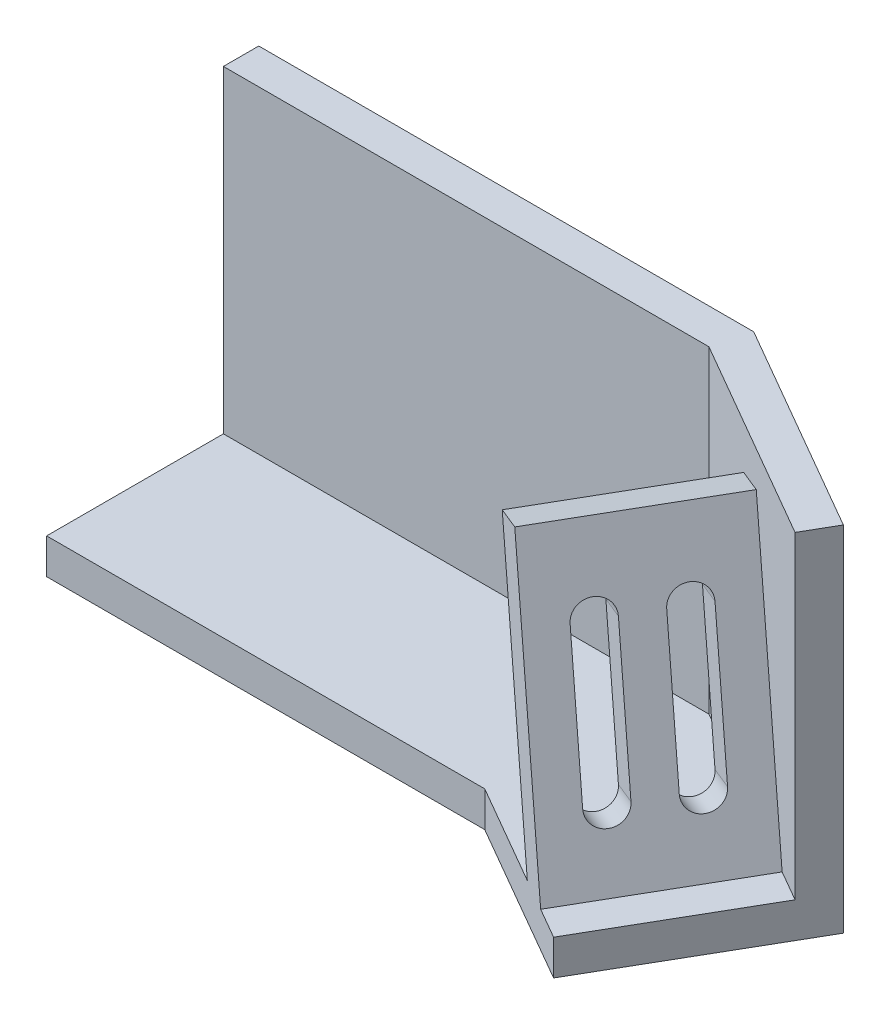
ISO-10303-21;
HEADER;
FILE_DESCRIPTION(('STEP AP214'),'2;1');
FILE_NAME('part.step','',(''),(''),'','','');
FILE_SCHEMA(('AUTOMOTIVE_DESIGN { 1 0 10303 214 1 1 1 1 }'));
ENDSEC;
DATA;
#1=APPLICATION_CONTEXT('core data for automotive mechanical design processes');
#2=APPLICATION_PROTOCOL_DEFINITION('international standard','automotive_design',2000,#1);
#3=PRODUCT_CONTEXT('',#1,'mechanical');
#4=PRODUCT('Part','Part','',(#3));
#5=PRODUCT_RELATED_PRODUCT_CATEGORY('part','',(#4));
#6=PRODUCT_DEFINITION_FORMATION('','',#4);
#7=PRODUCT_DEFINITION_CONTEXT('part definition',#1,'design');
#8=PRODUCT_DEFINITION('design','',#6,#7);
#9=PRODUCT_DEFINITION_SHAPE('','',#8);
#10=(LENGTH_UNIT() NAMED_UNIT(*) SI_UNIT(.MILLI.,.METRE.));
#11=(NAMED_UNIT(*) PLANE_ANGLE_UNIT() SI_UNIT($,.RADIAN.));
#12=(NAMED_UNIT(*) SI_UNIT($,.STERADIAN.) SOLID_ANGLE_UNIT());
#13=UNCERTAINTY_MEASURE_WITH_UNIT(LENGTH_MEASURE(1.E-05),#10,'distance_accuracy_value','');
#14=(GEOMETRIC_REPRESENTATION_CONTEXT(3) GLOBAL_UNCERTAINTY_ASSIGNED_CONTEXT((#13)) GLOBAL_UNIT_ASSIGNED_CONTEXT((#10,
#11,#12)) REPRESENTATION_CONTEXT('',''));
#15=CARTESIAN_POINT('',(0.,0.,0.));
#16=DIRECTION('',(0.,0.,1.));
#17=DIRECTION('',(1.,0.,0.));
#18=AXIS2_PLACEMENT_3D('',#15,#16,#17);
#19=CARTESIAN_POINT('',(67.5,50.,4.33012701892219));
#20=DIRECTION('',(-0.500000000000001,0.,0.866025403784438));
#21=DIRECTION('',(0.866025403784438,0.,0.500000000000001));
#22=AXIS2_PLACEMENT_3D('',#19,#20,#21);
#23=PLANE('',#22);
#24=DIRECTION('',(-0.866025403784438,0.,-0.500000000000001));
#25=VECTOR('',#24,1.);
#26=CARTESIAN_POINT('',(15.0000000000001,5.,-25.9807621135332));
#27=LINE('',#26,#25);
#28=CARTESIAN_POINT('',(88.7064802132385,5.,16.5736940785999));
#29=VERTEX_POINT('',#28);
#30=CARTESIAN_POINT('',(68.6602540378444,5.,5.));
#31=VERTEX_POINT('',#30);
#32=EDGE_CURVE('E270',#29,#31,#27,.T.);
#33=ORIENTED_EDGE('',*,*,#32,.F.);
#34=DIRECTION('',(0.210042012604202,-0.970142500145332,0.121267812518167));
#35=VECTOR('',#34,1.);
#36=CARTESIAN_POINT('',(88.7064802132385,5.,16.5736940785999));
#37=LINE('',#36,#35);
#38=CARTESIAN_POINT('',(80.3087786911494,43.7873218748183,11.7252788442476));
#39=VERTEX_POINT('',#38);
#40=EDGE_CURVE('E253',#39,#29,#37,.T.);
#41=ORIENTED_EDGE('',*,*,#40,.F.);
#42=DIRECTION('',(-0.840168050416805,-0.242535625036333,-0.485071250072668));
#43=VECTOR('',#42,1.);
#44=CARTESIAN_POINT('',(80.3087786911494,43.7873218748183,11.7252788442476));
#45=LINE('',#44,#43);
#46=CARTESIAN_POINT('',(84.5096189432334,45.,14.150635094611));
#47=VERTEX_POINT('',#46);
#48=EDGE_CURVE('E250',#47,#39,#45,.T.);
#49=ORIENTED_EDGE('',*,*,#48,.F.);
#50=DIRECTION('',(-0.210042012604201,0.970142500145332,-0.121267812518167));
#51=VECTOR('',#50,1.);
#52=CARTESIAN_POINT('',(84.5096189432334,45.,14.150635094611));
#53=LINE('',#52,#51);
#54=CARTESIAN_POINT('',(93.1698729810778,5.,19.150635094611));
#55=VERTEX_POINT('',#54);
#56=EDGE_CURVE('E236',#55,#47,#53,.T.);
#57=ORIENTED_EDGE('',*,*,#56,.F.);
#58=CARTESIAN_POINT('',(97.5,5.,21.650635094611));
#59=VERTEX_POINT('',#58);
#60=EDGE_CURVE('E266',#59,#55,#27,.T.);
#61=ORIENTED_EDGE('',*,*,#60,.F.);
#62=DIRECTION('',(0.,-1.,0.));
#63=VECTOR('',#62,1.);
#64=CARTESIAN_POINT('',(97.5,50.,21.650635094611));
#65=LINE('',#64,#63);
#66=CARTESIAN_POINT('',(97.5,50.,21.650635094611));
#67=VERTEX_POINT('',#66);
#68=EDGE_CURVE('E274',#67,#59,#65,.T.);
#69=ORIENTED_EDGE('',*,*,#68,.F.);
#70=DIRECTION('',(-0.866025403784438,0.,-0.500000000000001));
#71=VECTOR('',#70,1.);
#72=CARTESIAN_POINT('',(15.0000000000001,50.,-25.9807621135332));
#73=LINE('',#72,#71);
#74=CARTESIAN_POINT('',(68.6602540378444,50.,5.));
#75=VERTEX_POINT('',#74);
#76=EDGE_CURVE('E277',#67,#75,#73,.T.);
#77=ORIENTED_EDGE('',*,*,#76,.T.);
#78=DIRECTION('',(0.,-1.,0.));
#79=VECTOR('',#78,1.);
#80=CARTESIAN_POINT('',(68.6602540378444,50.,5.));
#81=LINE('',#80,#79);
#82=EDGE_CURVE('E271',#75,#31,#81,.T.);
#83=ORIENTED_EDGE('',*,*,#82,.T.);
#84=EDGE_LOOP('',(#33,#41,#49,#57,#61,#69,#77,#83));
#85=FACE_BOUND('',#84,.T.);
#86=ADVANCED_FACE('F33',(#85),#23,.T.);
#87=CARTESIAN_POINT('',(0.,5.,0.));
#88=DIRECTION('',(0.,-1.,0.));
#89=DIRECTION('',(0.,0.,-1.));
#90=AXIS2_PLACEMENT_3D('',#87,#88,#89);
#91=PLANE('',#90);
#92=DIRECTION('',(0.500000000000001,0.,-0.866025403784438));
#93=VECTOR('',#92,1.);
#94=CARTESIAN_POINT('',(54.872565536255,5.,75.1757533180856));
#95=LINE('',#94,#93);
#96=CARTESIAN_POINT('',(76.2064802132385,5.,38.2243291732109));
#97=VERTEX_POINT('',#96);
#98=EDGE_CURVE('E259',#97,#29,#95,.T.);
#99=ORIENTED_EDGE('',*,*,#98,.T.);
#100=ORIENTED_EDGE('',*,*,#32,.T.);
#101=DIRECTION('',(-1.,0.,0.));
#102=VECTOR('',#101,1.);
#103=CARTESIAN_POINT('',(0.,5.,5.));
#104=LINE('',#103,#102);
#105=CARTESIAN_POINT('',(0.,5.,5.));
#106=VERTEX_POINT('',#105);
#107=EDGE_CURVE('E269',#31,#106,#104,.T.);
#108=ORIENTED_EDGE('',*,*,#107,.T.);
#109=DIRECTION('',(0.,0.,1.));
#110=VECTOR('',#109,1.);
#111=CARTESIAN_POINT('',(0.,5.,0.));
#112=LINE('',#111,#110);
#113=CARTESIAN_POINT('',(0.,5.,30.));
#114=VERTEX_POINT('',#113);
#115=EDGE_CURVE('E247',#106,#114,#112,.T.);
#116=ORIENTED_EDGE('',*,*,#115,.T.);
#117=DIRECTION('',(1.,0.,0.));
#118=VECTOR('',#117,1.);
#119=CARTESIAN_POINT('',(0.,5.,30.));
#120=LINE('',#119,#118);
#121=CARTESIAN_POINT('',(61.9615242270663,5.,30.));
#122=VERTEX_POINT('',#121);
#123=EDGE_CURVE('E285',#114,#122,#120,.T.);
#124=ORIENTED_EDGE('',*,*,#123,.T.);
#125=DIRECTION('',(0.866025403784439,0.,0.5));
#126=VECTOR('',#125,1.);
#127=CARTESIAN_POINT('',(2.49999999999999,5.,-4.33012701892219));
#128=LINE('',#127,#126);
#129=EDGE_CURVE('E288',#122,#97,#128,.T.);
#130=ORIENTED_EDGE('',*,*,#129,.T.);
#131=EDGE_LOOP('',(#99,#100,#108,#116,#124,#130));
#132=FACE_BOUND('',#131,.T.);
#133=ADVANCED_FACE('F376',(#132),#91,.F.);
#134=DIRECTION('',(0.500000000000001,0.,-0.866025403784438));
#135=VECTOR('',#134,1.);
#136=CARTESIAN_POINT('',(59.3359583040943,5.,77.7526943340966));
#137=LINE('',#136,#135);
#138=CARTESIAN_POINT('',(80.6698729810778,5.,40.8012701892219));
#139=VERTEX_POINT('',#138);
#140=EDGE_CURVE('E256',#139,#55,#137,.T.);
#141=ORIENTED_EDGE('',*,*,#140,.F.);
#142=CARTESIAN_POINT('',(85.,5.,43.3012701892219));
#143=VERTEX_POINT('',#142);
#144=EDGE_CURVE('E287',#139,#143,#128,.T.);
#145=ORIENTED_EDGE('',*,*,#144,.T.);
#146=DIRECTION('',(0.5,0.,-0.866025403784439));
#147=VECTOR('',#146,1.);
#148=CARTESIAN_POINT('',(82.5,5.,47.6313972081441));
#149=LINE('',#148,#147);
#150=EDGE_CURVE('E290',#143,#59,#149,.T.);
#151=ORIENTED_EDGE('',*,*,#150,.T.);
#152=ORIENTED_EDGE('',*,*,#60,.T.);
#153=EDGE_LOOP('',(#141,#145,#151,#152));
#154=FACE_BOUND('',#153,.T.);
#155=ADVANCED_FACE('F366',(#154),#91,.F.);
#156=CARTESIAN_POINT('',(0.,50.,30.));
#157=DIRECTION('',(1.,0.,0.));
#158=DIRECTION('',(0.,0.,-1.));
#159=AXIS2_PLACEMENT_3D('',#156,#157,#158);
#160=PLANE('',#159);
#161=ORIENTED_EDGE('',*,*,#115,.F.);
#162=DIRECTION('',(0.,-1.,0.));
#163=VECTOR('',#162,1.);
#164=CARTESIAN_POINT('',(0.,50.,5.));
#165=LINE('',#164,#163);
#166=CARTESIAN_POINT('',(0.,50.,5.));
#167=VERTEX_POINT('',#166);
#168=EDGE_CURVE('E275',#167,#106,#165,.T.);
#169=ORIENTED_EDGE('',*,*,#168,.F.);
#170=DIRECTION('',(0.,0.,1.));
#171=VECTOR('',#170,1.);
#172=CARTESIAN_POINT('',(0.,50.,30.));
#173=LINE('',#172,#171);
#174=CARTESIAN_POINT('',(0.,50.,0.));
#175=VERTEX_POINT('',#174);
#176=EDGE_CURVE('E295',#175,#167,#173,.T.);
#177=ORIENTED_EDGE('',*,*,#176,.F.);
#178=DIRECTION('',(0.,-1.,0.));
#179=VECTOR('',#178,1.);
#180=CARTESIAN_POINT('',(0.,50.,0.));
#181=LINE('',#180,#179);
#182=CARTESIAN_POINT('',(0.,0.,0.));
#183=VERTEX_POINT('',#182);
#184=EDGE_CURVE('E305',#175,#183,#181,.T.);
#185=ORIENTED_EDGE('',*,*,#184,.T.);
#186=DIRECTION('',(0.,0.,1.));
#187=VECTOR('',#186,1.);
#188=CARTESIAN_POINT('',(0.,0.,30.));
#189=LINE('',#188,#187);
#190=CARTESIAN_POINT('',(0.,0.,30.));
#191=VERTEX_POINT('',#190);
#192=EDGE_CURVE('E294',#183,#191,#189,.T.);
#193=ORIENTED_EDGE('',*,*,#192,.T.);
#194=DIRECTION('',(0.,-1.,0.));
#195=VECTOR('',#194,1.);
#196=CARTESIAN_POINT('',(0.,50.,30.));
#197=LINE('',#196,#195);
#198=EDGE_CURVE('E11',#114,#191,#197,.T.);
#199=ORIENTED_EDGE('',*,*,#198,.F.);
#200=EDGE_LOOP('',(#161,#169,#177,#185,#193,#199));
#201=FACE_BOUND('',#200,.T.);
#202=ADVANCED_FACE('F35',(#201),#160,.F.);
#203=CARTESIAN_POINT('',(0.,50.,30.));
#204=DIRECTION('',(0.,0.,-1.));
#205=DIRECTION('',(-1.,0.,0.));
#206=AXIS2_PLACEMENT_3D('',#203,#204,#205);
#207=PLANE('',#206);
#208=ORIENTED_EDGE('',*,*,#123,.F.);
#209=ORIENTED_EDGE('',*,*,#198,.T.);
#210=DIRECTION('',(1.,0.,0.));
#211=VECTOR('',#210,1.);
#212=CARTESIAN_POINT('',(0.,0.,30.));
#213=LINE('',#212,#211);
#214=CARTESIAN_POINT('',(61.9615242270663,0.,30.));
#215=VERTEX_POINT('',#214);
#216=EDGE_CURVE('E308',#191,#215,#213,.T.);
#217=ORIENTED_EDGE('',*,*,#216,.T.);
#218=DIRECTION('',(0.,-1.,0.));
#219=VECTOR('',#218,1.);
#220=CARTESIAN_POINT('',(61.9615242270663,50.,30.));
#221=LINE('',#220,#219);
#222=EDGE_CURVE('E41',#122,#215,#221,.T.);
#223=ORIENTED_EDGE('',*,*,#222,.F.);
#224=EDGE_LOOP('',(#208,#209,#217,#223));
#225=FACE_BOUND('',#224,.T.);
#226=ADVANCED_FACE('F339',(#225),#207,.F.);
#227=CARTESIAN_POINT('',(61.9615242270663,50.,30.));
#228=DIRECTION('',(0.5,0.,-0.866025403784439));
#229=DIRECTION('',(-0.866025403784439,0.,-0.5));
#230=AXIS2_PLACEMENT_3D('',#227,#228,#229);
#231=PLANE('',#230);
#232=ORIENTED_EDGE('',*,*,#129,.F.);
#233=ORIENTED_EDGE('',*,*,#222,.T.);
#234=DIRECTION('',(0.866025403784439,0.,0.5));
#235=VECTOR('',#234,1.);
#236=CARTESIAN_POINT('',(61.9615242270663,0.,30.));
#237=LINE('',#236,#235);
#238=CARTESIAN_POINT('',(85.,0.,43.3012701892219));
#239=VERTEX_POINT('',#238);
#240=EDGE_CURVE('E311',#215,#239,#237,.T.);
#241=ORIENTED_EDGE('',*,*,#240,.T.);
#242=DIRECTION('',(0.,-1.,0.));
#243=VECTOR('',#242,1.);
#244=CARTESIAN_POINT('',(85.,50.,43.3012701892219));
#245=LINE('',#244,#243);
#246=EDGE_CURVE('E327',#143,#239,#245,.T.);
#247=ORIENTED_EDGE('',*,*,#246,.F.);
#248=ORIENTED_EDGE('',*,*,#144,.F.);
#249=DIRECTION('',(0.210042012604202,-0.970142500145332,0.121267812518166));
#250=VECTOR('',#249,1.);
#251=CARTESIAN_POINT('',(72.0096189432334,45.,35.8012701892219));
#252=LINE('',#251,#250);
#253=CARTESIAN_POINT('',(72.0096189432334,45.,35.8012701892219));
#254=VERTEX_POINT('',#253);
#255=EDGE_CURVE('E244',#254,#139,#252,.T.);
#256=ORIENTED_EDGE('',*,*,#255,.F.);
#257=DIRECTION('',(0.840168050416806,0.242535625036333,0.485071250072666));
#258=VECTOR('',#257,1.);
#259=CARTESIAN_POINT('',(67.8087786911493,43.7873218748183,33.3759139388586));
#260=LINE('',#259,#258);
#261=CARTESIAN_POINT('',(67.8087786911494,43.7873218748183,33.3759139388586));
#262=VERTEX_POINT('',#261);
#263=EDGE_CURVE('E240',#262,#254,#260,.T.);
#264=ORIENTED_EDGE('',*,*,#263,.F.);
#265=DIRECTION('',(-0.210042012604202,0.970142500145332,-0.121267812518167));
#266=VECTOR('',#265,1.);
#267=CARTESIAN_POINT('',(76.2064802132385,5.00000000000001,38.2243291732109));
#268=LINE('',#267,#266);
#269=EDGE_CURVE('E237',#97,#262,#268,.T.);
#270=ORIENTED_EDGE('',*,*,#269,.F.);
#271=EDGE_LOOP('',(#232,#233,#241,#247,#248,#256,#264,#270));
#272=FACE_BOUND('',#271,.T.);
#273=ADVANCED_FACE('F331',(#272),#231,.F.);
#274=CARTESIAN_POINT('',(100.,50.,17.3205080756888));
#275=DIRECTION('',(-0.866025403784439,0.,-0.5));
#276=DIRECTION('',(-0.5,0.,0.866025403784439));
#277=AXIS2_PLACEMENT_3D('',#274,#275,#276);
#278=PLANE('',#277);
#279=ORIENTED_EDGE('',*,*,#150,.F.);
#280=ORIENTED_EDGE('',*,*,#246,.T.);
#281=DIRECTION('',(0.5,0.,-0.866025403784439));
#282=VECTOR('',#281,1.);
#283=CARTESIAN_POINT('',(100.,0.,17.3205080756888));
#284=LINE('',#283,#282);
#285=CARTESIAN_POINT('',(100.,0.,17.3205080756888));
#286=VERTEX_POINT('',#285);
#287=EDGE_CURVE('E314',#239,#286,#284,.T.);
#288=ORIENTED_EDGE('',*,*,#287,.T.);
#289=DIRECTION('',(0.,-1.,0.));
#290=VECTOR('',#289,1.);
#291=CARTESIAN_POINT('',(100.,50.,17.3205080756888));
#292=LINE('',#291,#290);
#293=CARTESIAN_POINT('',(100.,50.,17.3205080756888));
#294=VERTEX_POINT('',#293);
#295=EDGE_CURVE('E324',#294,#286,#292,.T.);
#296=ORIENTED_EDGE('',*,*,#295,.F.);
#297=DIRECTION('',(0.5,0.,-0.866025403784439));
#298=VECTOR('',#297,1.);
#299=CARTESIAN_POINT('',(100.,50.,17.3205080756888));
#300=LINE('',#299,#298);
#301=EDGE_CURVE('E298',#67,#294,#300,.T.);
#302=ORIENTED_EDGE('',*,*,#301,.F.);
#303=ORIENTED_EDGE('',*,*,#68,.T.);
#304=EDGE_LOOP('',(#279,#280,#288,#296,#302,#303));
#305=FACE_BOUND('',#304,.T.);
#306=ADVANCED_FACE('F349',(#305),#278,.F.);
#307=CARTESIAN_POINT('',(0.,50.,0.));
#308=DIRECTION('',(0.,-1.,0.));
#309=DIRECTION('',(0.,0.,-1.));
#310=AXIS2_PLACEMENT_3D('',#307,#308,#309);
#311=PLANE('',#310);
#312=ORIENTED_EDGE('',*,*,#76,.F.);
#313=ORIENTED_EDGE('',*,*,#301,.T.);
#314=DIRECTION('',(-0.866025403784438,0.,-0.500000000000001));
#315=VECTOR('',#314,1.);
#316=CARTESIAN_POINT('',(70.,50.,0.));
#317=LINE('',#316,#315);
#318=CARTESIAN_POINT('',(70.,50.,0.));
#319=VERTEX_POINT('',#318);
#320=EDGE_CURVE('E301',#294,#319,#317,.T.);
#321=ORIENTED_EDGE('',*,*,#320,.T.);
#322=DIRECTION('',(-1.,0.,0.));
#323=VECTOR('',#322,1.);
#324=CARTESIAN_POINT('',(0.,50.,0.));
#325=LINE('',#324,#323);
#326=EDGE_CURVE('E303',#319,#175,#325,.T.);
#327=ORIENTED_EDGE('',*,*,#326,.T.);
#328=ORIENTED_EDGE('',*,*,#176,.T.);
#329=DIRECTION('',(-1.,0.,0.));
#330=VECTOR('',#329,1.);
#331=CARTESIAN_POINT('',(0.,50.,5.));
#332=LINE('',#331,#330);
#333=EDGE_CURVE('E280',#75,#167,#332,.T.);
#334=ORIENTED_EDGE('',*,*,#333,.F.);
#335=EDGE_LOOP('',(#312,#313,#321,#327,#328,#334));
#336=FACE_BOUND('',#335,.T.);
#337=ADVANCED_FACE('F358',(#336),#311,.F.);
#338=CARTESIAN_POINT('',(70.,50.,0.));
#339=DIRECTION('',(-0.500000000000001,0.,0.866025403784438));
#340=DIRECTION('',(0.866025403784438,0.,0.500000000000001));
#341=AXIS2_PLACEMENT_3D('',#338,#339,#340);
#342=PLANE('',#341);
#343=DIRECTION('',(-0.866025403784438,0.,-0.500000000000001));
#344=VECTOR('',#343,1.);
#345=CARTESIAN_POINT('',(70.,0.,0.));
#346=LINE('',#345,#344);
#347=CARTESIAN_POINT('',(70.,0.,0.));
#348=VERTEX_POINT('',#347);
#349=EDGE_CURVE('E316',#286,#348,#346,.T.);
#350=ORIENTED_EDGE('',*,*,#349,.T.);
#351=DIRECTION('',(0.,-1.,0.));
#352=VECTOR('',#351,1.);
#353=CARTESIAN_POINT('',(70.,50.,0.));
#354=LINE('',#353,#352);
#355=EDGE_CURVE('E321',#319,#348,#354,.T.);
#356=ORIENTED_EDGE('',*,*,#355,.F.);
#357=ORIENTED_EDGE('',*,*,#320,.F.);
#358=ORIENTED_EDGE('',*,*,#295,.T.);
#359=EDGE_LOOP('',(#350,#356,#357,#358));
#360=FACE_BOUND('',#359,.T.);
#361=ADVANCED_FACE('F353',(#360),#342,.F.);
#362=CARTESIAN_POINT('',(0.,50.,0.));
#363=DIRECTION('',(0.,0.,1.));
#364=DIRECTION('',(1.,0.,0.));
#365=AXIS2_PLACEMENT_3D('',#362,#363,#364);
#366=PLANE('',#365);
#367=DIRECTION('',(-1.,0.,0.));
#368=VECTOR('',#367,1.);
#369=CARTESIAN_POINT('',(0.,0.,0.));
#370=LINE('',#369,#368);
#371=EDGE_CURVE('E299',#348,#183,#370,.T.);
#372=ORIENTED_EDGE('',*,*,#371,.T.);
#373=ORIENTED_EDGE('',*,*,#184,.F.);
#374=ORIENTED_EDGE('',*,*,#326,.F.);
#375=ORIENTED_EDGE('',*,*,#355,.T.);
#376=EDGE_LOOP('',(#372,#373,#374,#375));
#377=FACE_BOUND('',#376,.T.);
#378=ADVANCED_FACE('F385',(#377),#366,.F.);
#379=CARTESIAN_POINT('',(0.,0.,0.));
#380=DIRECTION('',(0.,-1.,0.));
#381=DIRECTION('',(0.,0.,-1.));
#382=AXIS2_PLACEMENT_3D('',#379,#380,#381);
#383=PLANE('',#382);
#384=ORIENTED_EDGE('',*,*,#192,.F.);
#385=ORIENTED_EDGE('',*,*,#371,.F.);
#386=ORIENTED_EDGE('',*,*,#349,.F.);
#387=ORIENTED_EDGE('',*,*,#287,.F.);
#388=ORIENTED_EDGE('',*,*,#240,.F.);
#389=ORIENTED_EDGE('',*,*,#216,.F.);
#390=EDGE_LOOP('',(#384,#385,#386,#387,#388,#389));
#391=FACE_BOUND('',#390,.T.);
#392=ADVANCED_FACE('F343',(#391),#383,.T.);
#393=CARTESIAN_POINT('',(0.,50.,5.));
#394=DIRECTION('',(0.,0.,1.));
#395=DIRECTION('',(1.,0.,0.));
#396=AXIS2_PLACEMENT_3D('',#393,#394,#395);
#397=PLANE('',#396);
#398=ORIENTED_EDGE('',*,*,#107,.F.);
#399=ORIENTED_EDGE('',*,*,#82,.F.);
#400=ORIENTED_EDGE('',*,*,#333,.T.);
#401=ORIENTED_EDGE('',*,*,#168,.T.);
#402=EDGE_LOOP('',(#398,#399,#400,#401));
#403=FACE_BOUND('',#402,.T.);
#404=ADVANCED_FACE('F379',(#403),#397,.T.);
#405=CARTESIAN_POINT('',(54.872565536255,5.,75.1757533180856));
#406=DIRECTION('',(0.840168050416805,0.242535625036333,0.485071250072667));
#407=DIRECTION('',(0.500000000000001,0.,-0.866025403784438));
#408=AXIS2_PLACEMENT_3D('',#405,#406,#407);
#409=PLANE('',#408);
#410=CARTESIAN_POINT('',(78.9177723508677,32.8915968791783,19.5824349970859));
#411=DIRECTION('',(0.840168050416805,0.242535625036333,0.485071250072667));
#412=DIRECTION('',(0.500000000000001,0.,-0.866025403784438));
#413=AXIS2_PLACEMENT_3D('',#410,#411,#412);
#414=CIRCLE('',#413,2.50000000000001);
#415=CARTESIAN_POINT('',(77.6677723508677,32.8915968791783,21.747498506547));
#416=VERTEX_POINT('',#415);
#417=CARTESIAN_POINT('',(80.1677723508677,32.8915968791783,17.4173714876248));
#418=VERTEX_POINT('',#417);
#419=EDGE_CURVE('E189',#416,#418,#414,.F.);
#420=ORIENTED_EDGE('',*,*,#419,.F.);
#421=DIRECTION('',(-0.210042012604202,0.970142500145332,-0.121267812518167));
#422=VECTOR('',#421,1.);
#423=CARTESIAN_POINT('',(77.6677723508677,32.8915968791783,21.747498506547));
#424=LINE('',#423,#422);
#425=CARTESIAN_POINT('',(81.8686126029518,13.4887468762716,24.1728547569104));
#426=VERTEX_POINT('',#425);
#427=EDGE_CURVE('E48',#426,#416,#424,.T.);
#428=ORIENTED_EDGE('',*,*,#427,.F.);
#429=CARTESIAN_POINT('',(83.1186126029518,13.4887468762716,22.0077912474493));
#430=DIRECTION('',(0.840168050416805,0.242535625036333,0.485071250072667));
#431=DIRECTION('',(0.500000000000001,0.,-0.866025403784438));
#432=AXIS2_PLACEMENT_3D('',#429,#430,#431);
#433=CIRCLE('',#432,2.50000000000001);
#434=CARTESIAN_POINT('',(84.3686126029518,13.4887468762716,19.8427277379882));
#435=VERTEX_POINT('',#434);
#436=EDGE_CURVE('E583',#435,#426,#433,.F.);
#437=ORIENTED_EDGE('',*,*,#436,.F.);
#438=DIRECTION('',(0.210042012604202,-0.970142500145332,0.121267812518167));
#439=VECTOR('',#438,1.);
#440=CARTESIAN_POINT('',(80.1677723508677,32.8915968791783,17.4173714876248));
#441=LINE('',#440,#439);
#442=EDGE_CURVE('E581',#418,#435,#441,.T.);
#443=ORIENTED_EDGE('',*,*,#442,.F.);
#444=EDGE_LOOP('',(#420,#428,#437,#443));
#445=FACE_BOUND('',#444,.T.);
#446=CARTESIAN_POINT('',(73.9177723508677,32.8915968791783,28.2426890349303));
#447=DIRECTION('',(0.840168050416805,0.242535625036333,0.485071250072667));
#448=DIRECTION('',(0.500000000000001,0.,-0.866025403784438));
#449=AXIS2_PLACEMENT_3D('',#446,#447,#448);
#450=CIRCLE('',#449,2.5);
#451=CARTESIAN_POINT('',(72.6677723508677,32.8915968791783,30.4077525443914));
#452=VERTEX_POINT('',#451);
#453=CARTESIAN_POINT('',(75.1677723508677,32.8915968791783,26.0776255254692));
#454=VERTEX_POINT('',#453);
#455=EDGE_CURVE('E211',#452,#454,#450,.F.);
#456=ORIENTED_EDGE('',*,*,#455,.F.);
#457=DIRECTION('',(-0.210042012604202,0.970142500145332,-0.121267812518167));
#458=VECTOR('',#457,1.);
#459=CARTESIAN_POINT('',(72.6677723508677,32.8915968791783,30.4077525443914));
#460=LINE('',#459,#458);
#461=CARTESIAN_POINT('',(76.8686126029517,13.4887468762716,32.8331087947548));
#462=VERTEX_POINT('',#461);
#463=EDGE_CURVE('E229',#462,#452,#460,.T.);
#464=ORIENTED_EDGE('',*,*,#463,.F.);
#465=CARTESIAN_POINT('',(78.1186126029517,13.4887468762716,30.6680452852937));
#466=DIRECTION('',(0.840168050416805,0.242535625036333,0.485071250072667));
#467=DIRECTION('',(0.500000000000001,0.,-0.866025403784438));
#468=AXIS2_PLACEMENT_3D('',#465,#466,#467);
#469=CIRCLE('',#468,2.5);
#470=CARTESIAN_POINT('',(79.3686126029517,13.4887468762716,28.5029817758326));
#471=VERTEX_POINT('',#470);
#472=EDGE_CURVE('E205',#471,#462,#469,.F.);
#473=ORIENTED_EDGE('',*,*,#472,.F.);
#474=DIRECTION('',(0.210042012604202,-0.970142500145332,0.121267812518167));
#475=VECTOR('',#474,1.);
#476=CARTESIAN_POINT('',(75.1677723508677,32.8915968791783,26.0776255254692));
#477=LINE('',#476,#475);
#478=EDGE_CURVE('E208',#454,#471,#477,.T.);
#479=ORIENTED_EDGE('',*,*,#478,.F.);
#480=EDGE_LOOP('',(#456,#464,#473,#479));
#481=FACE_BOUND('',#480,.T.);
#482=ORIENTED_EDGE('',*,*,#98,.F.);
#483=ORIENTED_EDGE('',*,*,#269,.T.);
#484=DIRECTION('',(0.500000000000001,0.,-0.866025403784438));
#485=VECTOR('',#484,1.);
#486=CARTESIAN_POINT('',(46.4748640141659,43.7873218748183,70.3273380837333));
#487=LINE('',#486,#485);
#488=EDGE_CURVE('E261',#262,#39,#487,.T.);
#489=ORIENTED_EDGE('',*,*,#488,.T.);
#490=ORIENTED_EDGE('',*,*,#40,.T.);
#491=EDGE_LOOP('',(#482,#483,#489,#490));
#492=FACE_BOUND('',#491,.T.);
#493=ADVANCED_FACE('F374',(#445,#481,#492),#409,.F.);
#494=CARTESIAN_POINT('',(46.4748640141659,43.7873218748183,70.3273380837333));
#495=DIRECTION('',(0.210042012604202,-0.970142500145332,0.121267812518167));
#496=DIRECTION('',(0.977355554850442,0.21160368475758,0.));
#497=AXIS2_PLACEMENT_3D('',#494,#495,#496);
#498=PLANE('',#497);
#499=ORIENTED_EDGE('',*,*,#488,.F.);
#500=ORIENTED_EDGE('',*,*,#263,.T.);
#501=DIRECTION('',(0.500000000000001,0.,-0.866025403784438));
#502=VECTOR('',#501,1.);
#503=CARTESIAN_POINT('',(50.6757042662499,45.,72.7526943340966));
#504=LINE('',#503,#502);
#505=EDGE_CURVE('E241',#254,#47,#504,.T.);
#506=ORIENTED_EDGE('',*,*,#505,.T.);
#507=ORIENTED_EDGE('',*,*,#48,.T.);
#508=EDGE_LOOP('',(#499,#500,#506,#507));
#509=FACE_BOUND('',#508,.T.);
#510=ADVANCED_FACE('F372',(#509),#498,.F.);
#511=CARTESIAN_POINT('',(50.6757042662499,45.,72.7526943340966));
#512=DIRECTION('',(-0.840168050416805,-0.242535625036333,-0.485071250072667));
#513=DIRECTION('',(-0.500000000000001,0.,0.866025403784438));
#514=AXIS2_PLACEMENT_3D('',#511,#512,#513);
#515=PLANE('',#514);
#516=CARTESIAN_POINT('',(87.3194528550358,14.7014250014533,24.4331474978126));
#517=DIRECTION('',(0.840168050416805,0.242535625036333,0.485071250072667));
#518=DIRECTION('',(0.500000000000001,0.,-0.866025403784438));
#519=AXIS2_PLACEMENT_3D('',#516,#517,#518);
#520=CIRCLE('',#519,2.50000000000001);
#521=CARTESIAN_POINT('',(86.0694528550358,14.7014250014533,26.5982110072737));
#522=VERTEX_POINT('',#521);
#523=CARTESIAN_POINT('',(88.5694528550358,14.7014250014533,22.2680839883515));
#524=VERTEX_POINT('',#523);
#525=EDGE_CURVE('E194',#522,#524,#520,.T.);
#526=ORIENTED_EDGE('',*,*,#525,.F.);
#527=DIRECTION('',(0.210042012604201,-0.970142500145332,0.121267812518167));
#528=VECTOR('',#527,1.);
#529=CARTESIAN_POINT('',(81.8686126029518,34.10427500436,24.1728547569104));
#530=LINE('',#529,#528);
#531=CARTESIAN_POINT('',(81.8686126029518,34.10427500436,24.1728547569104));
#532=VERTEX_POINT('',#531);
#533=EDGE_CURVE('E177',#532,#522,#530,.T.);
#534=ORIENTED_EDGE('',*,*,#533,.F.);
#535=CARTESIAN_POINT('',(83.1186126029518,34.10427500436,22.0077912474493));
#536=DIRECTION('',(0.840168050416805,0.242535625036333,0.485071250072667));
#537=DIRECTION('',(0.500000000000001,0.,-0.866025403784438));
#538=AXIS2_PLACEMENT_3D('',#535,#536,#537);
#539=CIRCLE('',#538,2.50000000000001);
#540=CARTESIAN_POINT('',(84.3686126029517,34.10427500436,19.8427277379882));
#541=VERTEX_POINT('',#540);
#542=EDGE_CURVE('E185',#541,#532,#539,.T.);
#543=ORIENTED_EDGE('',*,*,#542,.F.);
#544=DIRECTION('',(-0.210042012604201,0.970142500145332,-0.121267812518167));
#545=VECTOR('',#544,1.);
#546=CARTESIAN_POINT('',(84.3686126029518,34.10427500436,19.8427277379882));
#547=LINE('',#546,#545);
#548=EDGE_CURVE('E56',#524,#541,#547,.T.);
#549=ORIENTED_EDGE('',*,*,#548,.F.);
#550=EDGE_LOOP('',(#526,#534,#543,#549));
#551=FACE_BOUND('',#550,.T.);
#552=CARTESIAN_POINT('',(82.3194528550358,14.7014250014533,33.093401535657));
#553=DIRECTION('',(0.840168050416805,0.242535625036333,0.485071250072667));
#554=DIRECTION('',(0.500000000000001,0.,-0.866025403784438));
#555=AXIS2_PLACEMENT_3D('',#552,#553,#554);
#556=CIRCLE('',#555,2.5);
#557=CARTESIAN_POINT('',(81.0694528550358,14.7014250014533,35.2584650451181));
#558=VERTEX_POINT('',#557);
#559=CARTESIAN_POINT('',(83.5694528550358,14.7014250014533,30.9283380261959));
#560=VERTEX_POINT('',#559);
#561=EDGE_CURVE('E220',#558,#560,#556,.T.);
#562=ORIENTED_EDGE('',*,*,#561,.F.);
#563=DIRECTION('',(0.210042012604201,-0.970142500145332,0.121267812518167));
#564=VECTOR('',#563,1.);
#565=CARTESIAN_POINT('',(76.8686126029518,34.10427500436,32.8331087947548));
#566=LINE('',#565,#564);
#567=CARTESIAN_POINT('',(76.8686126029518,34.10427500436,32.8331087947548));
#568=VERTEX_POINT('',#567);
#569=EDGE_CURVE('E217',#568,#558,#566,.T.);
#570=ORIENTED_EDGE('',*,*,#569,.F.);
#571=CARTESIAN_POINT('',(78.1186126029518,34.10427500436,30.6680452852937));
#572=DIRECTION('',(0.840168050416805,0.242535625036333,0.485071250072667));
#573=DIRECTION('',(0.500000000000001,0.,-0.866025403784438));
#574=AXIS2_PLACEMENT_3D('',#571,#572,#573);
#575=CIRCLE('',#574,2.5);
#576=CARTESIAN_POINT('',(79.3686126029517,34.10427500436,28.5029817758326));
#577=VERTEX_POINT('',#576);
#578=EDGE_CURVE('E214',#577,#568,#575,.T.);
#579=ORIENTED_EDGE('',*,*,#578,.F.);
#580=DIRECTION('',(-0.210042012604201,0.970142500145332,-0.121267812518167));
#581=VECTOR('',#580,1.);
#582=CARTESIAN_POINT('',(79.3686126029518,34.10427500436,28.5029817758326));
#583=LINE('',#582,#581);
#584=EDGE_CURVE('E223',#560,#577,#583,.T.);
#585=ORIENTED_EDGE('',*,*,#584,.F.);
#586=EDGE_LOOP('',(#562,#570,#579,#585));
#587=FACE_BOUND('',#586,.T.);
#588=ORIENTED_EDGE('',*,*,#505,.F.);
#589=ORIENTED_EDGE('',*,*,#255,.T.);
#590=ORIENTED_EDGE('',*,*,#140,.T.);
#591=ORIENTED_EDGE('',*,*,#56,.T.);
#592=EDGE_LOOP('',(#588,#589,#590,#591));
#593=FACE_BOUND('',#592,.T.);
#594=ADVANCED_FACE('F191',(#551,#587,#593),#515,.F.);
#595=CARTESIAN_POINT('',(2.2767968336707,12.5714725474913,-10.2324961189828));
#596=DIRECTION('',(-0.500000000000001,0.,0.866025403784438));
#597=DIRECTION('',(0.866025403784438,0.,0.500000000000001));
#598=AXIS2_PLACEMENT_3D('',#595,#596,#597);
#599=PLANE('',#598);
#600=ORIENTED_EDGE('',*,*,#463,.T.);
#601=DIRECTION('',(0.840168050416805,0.242535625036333,0.485071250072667));
#602=VECTOR('',#601,1.);
#603=CARTESIAN_POINT('',(2.2767968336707,12.5714725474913,-10.2324961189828));
#604=LINE('',#603,#602);
#605=EDGE_CURVE('E225',#452,#568,#604,.T.);
#606=ORIENTED_EDGE('',*,*,#605,.T.);
#607=ORIENTED_EDGE('',*,*,#569,.T.);
#608=DIRECTION('',(0.840168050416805,0.242535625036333,0.485071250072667));
#609=VECTOR('',#608,1.);
#610=CARTESIAN_POINT('',(6.47763708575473,-6.8313774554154,-7.80713986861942));
#611=LINE('',#610,#609);
#612=EDGE_CURVE('E232',#462,#558,#611,.T.);
#613=ORIENTED_EDGE('',*,*,#612,.F.);
#614=EDGE_LOOP('',(#600,#606,#607,#613));
#615=FACE_BOUND('',#614,.T.);
#616=ADVANCED_FACE('F501',(#615),#599,.F.);
#617=CARTESIAN_POINT('',(7.72763708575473,-6.8313774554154,-9.97220337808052));
#618=DIRECTION('',(0.840168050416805,0.242535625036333,0.485071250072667));
#619=DIRECTION('',(0.500000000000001,0.,-0.866025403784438));
#620=AXIS2_PLACEMENT_3D('',#617,#618,#619);
#621=CYLINDRICAL_SURFACE('',#620,2.5);
#622=ORIENTED_EDGE('',*,*,#472,.T.);
#623=ORIENTED_EDGE('',*,*,#612,.T.);
#624=ORIENTED_EDGE('',*,*,#561,.T.);
#625=DIRECTION('',(0.840168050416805,0.242535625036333,0.485071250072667));
#626=VECTOR('',#625,1.);
#627=CARTESIAN_POINT('',(8.97763708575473,-6.8313774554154,-12.1372668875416));
#628=LINE('',#627,#626);
#629=EDGE_CURVE('E230',#471,#560,#628,.T.);
#630=ORIENTED_EDGE('',*,*,#629,.F.);
#631=EDGE_LOOP('',(#622,#623,#624,#630));
#632=FACE_BOUND('',#631,.T.);
#633=ADVANCED_FACE('F508',(#632),#621,.F.);
#634=CARTESIAN_POINT('',(4.7767968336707,12.5714725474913,-14.562623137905));
#635=DIRECTION('',(0.500000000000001,0.,-0.866025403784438));
#636=DIRECTION('',(-0.866025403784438,0.,-0.500000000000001));
#637=AXIS2_PLACEMENT_3D('',#634,#635,#636);
#638=PLANE('',#637);
#639=ORIENTED_EDGE('',*,*,#478,.T.);
#640=ORIENTED_EDGE('',*,*,#629,.T.);
#641=ORIENTED_EDGE('',*,*,#584,.T.);
#642=DIRECTION('',(0.840168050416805,0.242535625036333,0.485071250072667));
#643=VECTOR('',#642,1.);
#644=CARTESIAN_POINT('',(4.7767968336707,12.5714725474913,-14.562623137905));
#645=LINE('',#644,#643);
#646=EDGE_CURVE('E226',#454,#577,#645,.T.);
#647=ORIENTED_EDGE('',*,*,#646,.F.);
#648=EDGE_LOOP('',(#639,#640,#641,#647));
#649=FACE_BOUND('',#648,.T.);
#650=ADVANCED_FACE('F517',(#649),#638,.F.);
#651=CARTESIAN_POINT('',(3.5267968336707,12.5714725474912,-12.3975596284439));
#652=DIRECTION('',(0.840168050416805,0.242535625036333,0.485071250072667));
#653=DIRECTION('',(0.500000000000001,0.,-0.866025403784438));
#654=AXIS2_PLACEMENT_3D('',#651,#652,#653);
#655=CYLINDRICAL_SURFACE('',#654,2.5);
#656=ORIENTED_EDGE('',*,*,#455,.T.);
#657=ORIENTED_EDGE('',*,*,#646,.T.);
#658=ORIENTED_EDGE('',*,*,#578,.T.);
#659=ORIENTED_EDGE('',*,*,#605,.F.);
#660=EDGE_LOOP('',(#656,#657,#658,#659));
#661=FACE_BOUND('',#660,.T.);
#662=ADVANCED_FACE('F526',(#661),#655,.F.);
#663=CARTESIAN_POINT('',(7.2767968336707,12.5714725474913,-18.8927501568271));
#664=DIRECTION('',(-0.500000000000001,0.,0.866025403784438));
#665=DIRECTION('',(0.866025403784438,0.,0.500000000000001));
#666=AXIS2_PLACEMENT_3D('',#663,#664,#665);
#667=PLANE('',#666);
#668=ORIENTED_EDGE('',*,*,#427,.T.);
#669=DIRECTION('',(0.840168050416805,0.242535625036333,0.485071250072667));
#670=VECTOR('',#669,1.);
#671=CARTESIAN_POINT('',(7.2767968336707,12.5714725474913,-18.8927501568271));
#672=LINE('',#671,#670);
#673=EDGE_CURVE('E173',#416,#532,#672,.T.);
#674=ORIENTED_EDGE('',*,*,#673,.T.);
#675=ORIENTED_EDGE('',*,*,#533,.T.);
#676=DIRECTION('',(0.840168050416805,0.242535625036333,0.485071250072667));
#677=VECTOR('',#676,1.);
#678=CARTESIAN_POINT('',(11.4776370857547,-6.83137745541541,-16.4673939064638));
#679=LINE('',#678,#677);
#680=EDGE_CURVE('E182',#426,#522,#679,.T.);
#681=ORIENTED_EDGE('',*,*,#680,.F.);
#682=EDGE_LOOP('',(#668,#674,#675,#681));
#683=FACE_BOUND('',#682,.T.);
#684=ADVANCED_FACE('F175',(#683),#667,.F.);
#685=CARTESIAN_POINT('',(12.7276370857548,-6.83137745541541,-18.6324574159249));
#686=DIRECTION('',(0.840168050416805,0.242535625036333,0.485071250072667));
#687=DIRECTION('',(0.500000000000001,0.,-0.866025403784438));
#688=AXIS2_PLACEMENT_3D('',#685,#686,#687);
#689=CYLINDRICAL_SURFACE('',#688,2.50000000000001);
#690=ORIENTED_EDGE('',*,*,#436,.T.);
#691=ORIENTED_EDGE('',*,*,#680,.T.);
#692=ORIENTED_EDGE('',*,*,#525,.T.);
#693=DIRECTION('',(0.840168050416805,0.242535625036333,0.485071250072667));
#694=VECTOR('',#693,1.);
#695=CARTESIAN_POINT('',(13.9776370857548,-6.83137745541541,-20.797520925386));
#696=LINE('',#695,#694);
#697=EDGE_CURVE('E201',#435,#524,#696,.T.);
#698=ORIENTED_EDGE('',*,*,#697,.F.);
#699=EDGE_LOOP('',(#690,#691,#692,#698));
#700=FACE_BOUND('',#699,.T.);
#701=ADVANCED_FACE('F543',(#700),#689,.F.);
#702=CARTESIAN_POINT('',(9.77679683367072,12.5714725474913,-23.2228771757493));
#703=DIRECTION('',(0.500000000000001,0.,-0.866025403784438));
#704=DIRECTION('',(-0.866025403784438,0.,-0.500000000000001));
#705=AXIS2_PLACEMENT_3D('',#702,#703,#704);
#706=PLANE('',#705);
#707=ORIENTED_EDGE('',*,*,#442,.T.);
#708=ORIENTED_EDGE('',*,*,#697,.T.);
#709=ORIENTED_EDGE('',*,*,#548,.T.);
#710=DIRECTION('',(0.840168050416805,0.242535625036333,0.485071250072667));
#711=VECTOR('',#710,1.);
#712=CARTESIAN_POINT('',(9.77679683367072,12.5714725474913,-23.2228771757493));
#713=LINE('',#712,#711);
#714=EDGE_CURVE('E187',#418,#541,#713,.T.);
#715=ORIENTED_EDGE('',*,*,#714,.F.);
#716=EDGE_LOOP('',(#707,#708,#709,#715));
#717=FACE_BOUND('',#716,.T.);
#718=ADVANCED_FACE('F551',(#717),#706,.F.);
#719=CARTESIAN_POINT('',(8.52679683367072,12.5714725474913,-21.0578136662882));
#720=DIRECTION('',(0.840168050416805,0.242535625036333,0.485071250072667));
#721=DIRECTION('',(0.500000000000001,0.,-0.866025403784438));
#722=AXIS2_PLACEMENT_3D('',#719,#720,#721);
#723=CYLINDRICAL_SURFACE('',#722,2.50000000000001);
#724=ORIENTED_EDGE('',*,*,#419,.T.);
#725=ORIENTED_EDGE('',*,*,#714,.T.);
#726=ORIENTED_EDGE('',*,*,#542,.T.);
#727=ORIENTED_EDGE('',*,*,#673,.F.);
#728=EDGE_LOOP('',(#724,#725,#726,#727));
#729=FACE_BOUND('',#728,.T.);
#730=ADVANCED_FACE('F186',(#729),#723,.F.);
#731=CLOSED_SHELL('',(#86,#133,#155,#202,#226,#273,#306,#337,#361,#378,#392,#404,#493,#510,#594,
#616,#633,#650,#662,#684,#701,#718,#730));
#732=MANIFOLD_SOLID_BREP('B2',#731);
#733=ADVANCED_BREP_SHAPE_REPRESENTATION('',(#18,#732),#14);
#734=SHAPE_DEFINITION_REPRESENTATION(#9,#733);
ENDSEC;
END-ISO-10303-21;
